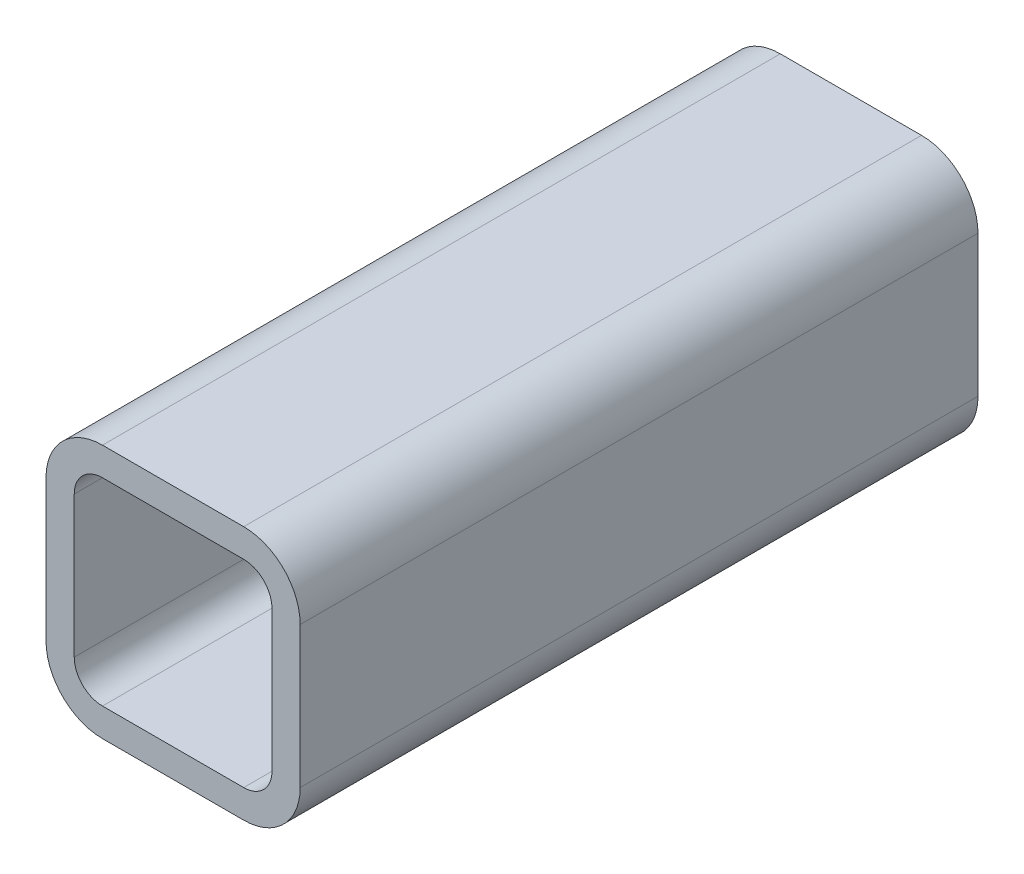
ISO-10303-21;
HEADER;
FILE_DESCRIPTION(('STEP AP214'),'2;1');
FILE_NAME('part.step','',(''),(''),'','','');
FILE_SCHEMA(('AUTOMOTIVE_DESIGN { 1 0 10303 214 1 1 1 1 }'));
ENDSEC;
DATA;
#1=APPLICATION_CONTEXT('core data for automotive mechanical design processes');
#2=APPLICATION_PROTOCOL_DEFINITION('international standard','automotive_design',2000,#1);
#3=PRODUCT_CONTEXT('',#1,'mechanical');
#4=PRODUCT('Part','Part','',(#3));
#5=PRODUCT_RELATED_PRODUCT_CATEGORY('part','',(#4));
#6=PRODUCT_DEFINITION_FORMATION('','',#4);
#7=PRODUCT_DEFINITION_CONTEXT('part definition',#1,'design');
#8=PRODUCT_DEFINITION('design','',#6,#7);
#9=PRODUCT_DEFINITION_SHAPE('','',#8);
#10=(LENGTH_UNIT() NAMED_UNIT(*) SI_UNIT(.MILLI.,.METRE.));
#11=(NAMED_UNIT(*) PLANE_ANGLE_UNIT() SI_UNIT($,.RADIAN.));
#12=(NAMED_UNIT(*) SI_UNIT($,.STERADIAN.) SOLID_ANGLE_UNIT());
#13=UNCERTAINTY_MEASURE_WITH_UNIT(LENGTH_MEASURE(1.E-05),#10,'distance_accuracy_value','');
#14=(GEOMETRIC_REPRESENTATION_CONTEXT(3) GLOBAL_UNCERTAINTY_ASSIGNED_CONTEXT((#13)) GLOBAL_UNIT_ASSIGNED_CONTEXT((#10,
#11,#12)) REPRESENTATION_CONTEXT('',''));
#15=CARTESIAN_POINT('',(0.,0.,0.));
#16=DIRECTION('',(0.,0.,1.));
#17=DIRECTION('',(1.,0.,0.));
#18=AXIS2_PLACEMENT_3D('',#15,#16,#17);
#19=CARTESIAN_POINT('',(26.6682087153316,89.6786017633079,304.8));
#20=DIRECTION('',(0.,0.,1.));
#21=DIRECTION('',(1.,0.,0.));
#22=AXIS2_PLACEMENT_3D('',#19,#20,#21);
#23=PLANE('',#22);
#24=CARTESIAN_POINT('',(26.6682087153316,89.6786017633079,304.8));
#25=DIRECTION('',(0.,0.,1.));
#26=DIRECTION('',(1.,0.,0.));
#27=AXIS2_PLACEMENT_3D('',#24,#25,#26);
#28=CIRCLE('',#27,25.4);
#29=CARTESIAN_POINT('',(26.6682087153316,115.078601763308,304.8));
#30=VERTEX_POINT('',#29);
#31=CARTESIAN_POINT('',(1.26820871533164,89.6786017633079,304.8));
#32=VERTEX_POINT('',#31);
#33=EDGE_CURVE('E211',#30,#32,#28,.T.);
#34=ORIENTED_EDGE('',*,*,#33,.T.);
#35=DIRECTION('',(0.,-1.,0.));
#36=VECTOR('',#35,1.);
#37=CARTESIAN_POINT('',(1.26820871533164,26.1786017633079,304.8));
#38=LINE('',#37,#36);
#39=CARTESIAN_POINT('',(1.26820871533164,26.1786017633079,304.8));
#40=VERTEX_POINT('',#39);
#41=EDGE_CURVE('E214',#32,#40,#38,.T.);
#42=ORIENTED_EDGE('',*,*,#41,.T.);
#43=CARTESIAN_POINT('',(26.6682087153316,26.1786017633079,304.8));
#44=DIRECTION('',(0.,0.,1.));
#45=DIRECTION('',(1.,0.,0.));
#46=AXIS2_PLACEMENT_3D('',#43,#44,#45);
#47=CIRCLE('',#46,25.4);
#48=CARTESIAN_POINT('',(26.6682087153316,0.77860176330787,304.8));
#49=VERTEX_POINT('',#48);
#50=EDGE_CURVE('E217',#40,#49,#47,.T.);
#51=ORIENTED_EDGE('',*,*,#50,.T.);
#52=DIRECTION('',(1.,0.,0.));
#53=VECTOR('',#52,1.);
#54=CARTESIAN_POINT('',(90.1682087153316,0.77860176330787,304.8));
#55=LINE('',#54,#53);
#56=CARTESIAN_POINT('',(90.1682087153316,0.778601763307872,304.8));
#57=VERTEX_POINT('',#56);
#58=EDGE_CURVE('E219',#49,#57,#55,.T.);
#59=ORIENTED_EDGE('',*,*,#58,.T.);
#60=CARTESIAN_POINT('',(90.1682087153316,26.1786017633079,304.8));
#61=DIRECTION('',(0.,0.,1.));
#62=DIRECTION('',(1.,0.,0.));
#63=AXIS2_PLACEMENT_3D('',#60,#61,#62);
#64=CIRCLE('',#63,25.4);
#65=CARTESIAN_POINT('',(115.568208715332,26.1786017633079,304.8));
#66=VERTEX_POINT('',#65);
#67=EDGE_CURVE('E221',#57,#66,#64,.T.);
#68=ORIENTED_EDGE('',*,*,#67,.T.);
#69=DIRECTION('',(0.,1.,0.));
#70=VECTOR('',#69,1.);
#71=CARTESIAN_POINT('',(115.568208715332,89.6786017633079,304.8));
#72=LINE('',#71,#70);
#73=CARTESIAN_POINT('',(115.568208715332,89.6786017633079,304.8));
#74=VERTEX_POINT('',#73);
#75=EDGE_CURVE('E223',#66,#74,#72,.T.);
#76=ORIENTED_EDGE('',*,*,#75,.T.);
#77=CARTESIAN_POINT('',(90.1682087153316,89.6786017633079,304.8));
#78=DIRECTION('',(0.,0.,1.));
#79=DIRECTION('',(1.,0.,0.));
#80=AXIS2_PLACEMENT_3D('',#77,#78,#79);
#81=CIRCLE('',#80,25.4);
#82=CARTESIAN_POINT('',(90.1682087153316,115.078601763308,304.8));
#83=VERTEX_POINT('',#82);
#84=EDGE_CURVE('E225',#74,#83,#81,.T.);
#85=ORIENTED_EDGE('',*,*,#84,.T.);
#86=DIRECTION('',(-1.,0.,0.));
#87=VECTOR('',#86,1.);
#88=CARTESIAN_POINT('',(26.6682087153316,115.078601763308,304.8));
#89=LINE('',#88,#87);
#90=EDGE_CURVE('E227',#83,#30,#89,.T.);
#91=ORIENTED_EDGE('',*,*,#90,.T.);
#92=EDGE_LOOP('',(#34,#42,#51,#59,#68,#76,#85,#91));
#93=FACE_BOUND('',#92,.T.);
#94=DIRECTION('',(0.,-1.,0.));
#95=VECTOR('',#94,1.);
#96=CARTESIAN_POINT('',(13.9682087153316,26.1786017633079,304.8));
#97=LINE('',#96,#95);
#98=CARTESIAN_POINT('',(13.9682087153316,89.6786017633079,304.8));
#99=VERTEX_POINT('',#98);
#100=CARTESIAN_POINT('',(13.9682087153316,26.1786017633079,304.8));
#101=VERTEX_POINT('',#100);
#102=EDGE_CURVE('E154',#99,#101,#97,.T.);
#103=ORIENTED_EDGE('',*,*,#102,.F.);
#104=CARTESIAN_POINT('',(26.6682087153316,89.6786017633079,304.8));
#105=DIRECTION('',(0.,0.,1.));
#106=DIRECTION('',(1.,0.,0.));
#107=AXIS2_PLACEMENT_3D('',#104,#105,#106);
#108=CIRCLE('',#107,12.7);
#109=CARTESIAN_POINT('',(26.6682087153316,102.378601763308,304.8));
#110=VERTEX_POINT('',#109);
#111=EDGE_CURVE('E146',#110,#99,#108,.T.);
#112=ORIENTED_EDGE('',*,*,#111,.F.);
#113=DIRECTION('',(-1.,0.,0.));
#114=VECTOR('',#113,1.);
#115=CARTESIAN_POINT('',(26.6682087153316,102.378601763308,304.8));
#116=LINE('',#115,#114);
#117=CARTESIAN_POINT('',(90.1682087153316,102.378601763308,304.8));
#118=VERTEX_POINT('',#117);
#119=EDGE_CURVE('E179',#118,#110,#116,.T.);
#120=ORIENTED_EDGE('',*,*,#119,.F.);
#121=CARTESIAN_POINT('',(90.1682087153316,89.6786017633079,304.8));
#122=DIRECTION('',(0.,0.,1.));
#123=DIRECTION('',(1.,0.,0.));
#124=AXIS2_PLACEMENT_3D('',#121,#122,#123);
#125=CIRCLE('',#124,12.7);
#126=CARTESIAN_POINT('',(102.868208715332,89.6786017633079,304.8));
#127=VERTEX_POINT('',#126);
#128=EDGE_CURVE('E177',#127,#118,#125,.T.);
#129=ORIENTED_EDGE('',*,*,#128,.F.);
#130=DIRECTION('',(0.,1.,0.));
#131=VECTOR('',#130,1.);
#132=CARTESIAN_POINT('',(102.868208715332,89.6786017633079,304.8));
#133=LINE('',#132,#131);
#134=CARTESIAN_POINT('',(102.868208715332,26.1786017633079,304.8));
#135=VERTEX_POINT('',#134);
#136=EDGE_CURVE('E175',#135,#127,#133,.T.);
#137=ORIENTED_EDGE('',*,*,#136,.F.);
#138=CARTESIAN_POINT('',(90.1682087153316,26.1786017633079,304.8));
#139=DIRECTION('',(0.,0.,1.));
#140=DIRECTION('',(1.,0.,0.));
#141=AXIS2_PLACEMENT_3D('',#138,#139,#140);
#142=CIRCLE('',#141,12.7);
#143=CARTESIAN_POINT('',(90.1682087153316,13.4786017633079,304.8));
#144=VERTEX_POINT('',#143);
#145=EDGE_CURVE('E173',#144,#135,#142,.T.);
#146=ORIENTED_EDGE('',*,*,#145,.F.);
#147=DIRECTION('',(1.,0.,0.));
#148=VECTOR('',#147,1.);
#149=CARTESIAN_POINT('',(90.1682087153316,13.4786017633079,304.8));
#150=LINE('',#149,#148);
#151=CARTESIAN_POINT('',(26.6682087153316,13.4786017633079,304.8));
#152=VERTEX_POINT('',#151);
#153=EDGE_CURVE('E169',#152,#144,#150,.T.);
#154=ORIENTED_EDGE('',*,*,#153,.F.);
#155=CARTESIAN_POINT('',(26.6682087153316,26.1786017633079,304.8));
#156=DIRECTION('',(0.,0.,1.));
#157=DIRECTION('',(1.,0.,0.));
#158=AXIS2_PLACEMENT_3D('',#155,#156,#157);
#159=CIRCLE('',#158,12.7);
#160=EDGE_CURVE('E167',#101,#152,#159,.T.);
#161=ORIENTED_EDGE('',*,*,#160,.F.);
#162=EDGE_LOOP('',(#103,#112,#120,#129,#137,#146,#154,#161));
#163=FACE_BOUND('',#162,.T.);
#164=ADVANCED_FACE('F33',(#93,#163),#23,.T.);
#165=CARTESIAN_POINT('',(26.6682087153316,89.6786017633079,0.));
#166=DIRECTION('',(0.,0.,1.));
#167=DIRECTION('',(1.,0.,0.));
#168=AXIS2_PLACEMENT_3D('',#165,#166,#167);
#169=PLANE('',#168);
#170=CARTESIAN_POINT('',(26.6682087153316,89.6786017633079,0.));
#171=DIRECTION('',(0.,0.,1.));
#172=DIRECTION('',(1.,0.,0.));
#173=AXIS2_PLACEMENT_3D('',#170,#171,#172);
#174=CIRCLE('',#173,25.4);
#175=CARTESIAN_POINT('',(26.6682087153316,115.078601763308,0.));
#176=VERTEX_POINT('',#175);
#177=CARTESIAN_POINT('',(1.26820871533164,89.6786017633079,0.));
#178=VERTEX_POINT('',#177);
#179=EDGE_CURVE('E162',#176,#178,#174,.T.);
#180=ORIENTED_EDGE('',*,*,#179,.F.);
#181=DIRECTION('',(-1.,0.,0.));
#182=VECTOR('',#181,1.);
#183=CARTESIAN_POINT('',(26.6682087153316,115.078601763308,0.));
#184=LINE('',#183,#182);
#185=CARTESIAN_POINT('',(90.1682087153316,115.078601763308,0.));
#186=VERTEX_POINT('',#185);
#187=EDGE_CURVE('E215',#186,#176,#184,.T.);
#188=ORIENTED_EDGE('',*,*,#187,.F.);
#189=CARTESIAN_POINT('',(90.1682087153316,89.6786017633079,0.));
#190=DIRECTION('',(0.,0.,1.));
#191=DIRECTION('',(1.,0.,0.));
#192=AXIS2_PLACEMENT_3D('',#189,#190,#191);
#193=CIRCLE('',#192,25.4);
#194=CARTESIAN_POINT('',(115.568208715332,89.6786017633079,0.));
#195=VERTEX_POINT('',#194);
#196=EDGE_CURVE('E242',#195,#186,#193,.T.);
#197=ORIENTED_EDGE('',*,*,#196,.F.);
#198=DIRECTION('',(0.,1.,0.));
#199=VECTOR('',#198,1.);
#200=CARTESIAN_POINT('',(115.568208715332,89.6786017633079,0.));
#201=LINE('',#200,#199);
#202=CARTESIAN_POINT('',(115.568208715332,26.1786017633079,0.));
#203=VERTEX_POINT('',#202);
#204=EDGE_CURVE('E240',#203,#195,#201,.T.);
#205=ORIENTED_EDGE('',*,*,#204,.F.);
#206=CARTESIAN_POINT('',(90.1682087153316,26.1786017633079,0.));
#207=DIRECTION('',(0.,0.,1.));
#208=DIRECTION('',(1.,0.,0.));
#209=AXIS2_PLACEMENT_3D('',#206,#207,#208);
#210=CIRCLE('',#209,25.4);
#211=CARTESIAN_POINT('',(90.1682087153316,0.778601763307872,0.));
#212=VERTEX_POINT('',#211);
#213=EDGE_CURVE('E238',#212,#203,#210,.T.);
#214=ORIENTED_EDGE('',*,*,#213,.F.);
#215=DIRECTION('',(1.,0.,0.));
#216=VECTOR('',#215,1.);
#217=CARTESIAN_POINT('',(90.1682087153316,0.77860176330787,0.));
#218=LINE('',#217,#216);
#219=CARTESIAN_POINT('',(26.6682087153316,0.77860176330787,0.));
#220=VERTEX_POINT('',#219);
#221=EDGE_CURVE('E236',#220,#212,#218,.T.);
#222=ORIENTED_EDGE('',*,*,#221,.F.);
#223=CARTESIAN_POINT('',(26.6682087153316,26.1786017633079,0.));
#224=DIRECTION('',(0.,0.,1.));
#225=DIRECTION('',(1.,0.,0.));
#226=AXIS2_PLACEMENT_3D('',#223,#224,#225);
#227=CIRCLE('',#226,25.4);
#228=CARTESIAN_POINT('',(1.26820871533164,26.1786017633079,0.));
#229=VERTEX_POINT('',#228);
#230=EDGE_CURVE('E234',#229,#220,#227,.T.);
#231=ORIENTED_EDGE('',*,*,#230,.F.);
#232=DIRECTION('',(0.,-1.,0.));
#233=VECTOR('',#232,1.);
#234=CARTESIAN_POINT('',(1.26820871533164,26.1786017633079,0.));
#235=LINE('',#234,#233);
#236=EDGE_CURVE('E232',#178,#229,#235,.T.);
#237=ORIENTED_EDGE('',*,*,#236,.F.);
#238=EDGE_LOOP('',(#180,#188,#197,#205,#214,#222,#231,#237));
#239=FACE_BOUND('',#238,.T.);
#240=CARTESIAN_POINT('',(26.6682087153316,89.6786017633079,0.));
#241=DIRECTION('',(0.,0.,1.));
#242=DIRECTION('',(1.,0.,0.));
#243=AXIS2_PLACEMENT_3D('',#240,#241,#242);
#244=CIRCLE('',#243,12.7);
#245=CARTESIAN_POINT('',(26.6682087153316,102.378601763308,0.));
#246=VERTEX_POINT('',#245);
#247=CARTESIAN_POINT('',(13.9682087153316,89.6786017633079,0.));
#248=VERTEX_POINT('',#247);
#249=EDGE_CURVE('E56',#246,#248,#244,.T.);
#250=ORIENTED_EDGE('',*,*,#249,.T.);
#251=DIRECTION('',(0.,-1.,0.));
#252=VECTOR('',#251,1.);
#253=CARTESIAN_POINT('',(13.9682087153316,26.1786017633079,0.));
#254=LINE('',#253,#252);
#255=CARTESIAN_POINT('',(13.9682087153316,26.1786017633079,0.));
#256=VERTEX_POINT('',#255);
#257=EDGE_CURVE('E161',#248,#256,#254,.T.);
#258=ORIENTED_EDGE('',*,*,#257,.T.);
#259=CARTESIAN_POINT('',(26.6682087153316,26.1786017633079,0.));
#260=DIRECTION('',(0.,0.,1.));
#261=DIRECTION('',(1.,0.,0.));
#262=AXIS2_PLACEMENT_3D('',#259,#260,#261);
#263=CIRCLE('',#262,12.7);
#264=CARTESIAN_POINT('',(26.6682087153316,13.4786017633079,0.));
#265=VERTEX_POINT('',#264);
#266=EDGE_CURVE('E183',#256,#265,#263,.T.);
#267=ORIENTED_EDGE('',*,*,#266,.T.);
#268=DIRECTION('',(1.,0.,0.));
#269=VECTOR('',#268,1.);
#270=CARTESIAN_POINT('',(90.1682087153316,13.4786017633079,0.));
#271=LINE('',#270,#269);
#272=CARTESIAN_POINT('',(90.1682087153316,13.4786017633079,0.));
#273=VERTEX_POINT('',#272);
#274=EDGE_CURVE('E186',#265,#273,#271,.T.);
#275=ORIENTED_EDGE('',*,*,#274,.T.);
#276=CARTESIAN_POINT('',(90.1682087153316,26.1786017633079,0.));
#277=DIRECTION('',(0.,0.,1.));
#278=DIRECTION('',(1.,0.,0.));
#279=AXIS2_PLACEMENT_3D('',#276,#277,#278);
#280=CIRCLE('',#279,12.7);
#281=CARTESIAN_POINT('',(102.868208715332,26.1786017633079,0.));
#282=VERTEX_POINT('',#281);
#283=EDGE_CURVE('E189',#273,#282,#280,.T.);
#284=ORIENTED_EDGE('',*,*,#283,.T.);
#285=DIRECTION('',(0.,1.,0.));
#286=VECTOR('',#285,1.);
#287=CARTESIAN_POINT('',(102.868208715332,89.6786017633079,0.));
#288=LINE('',#287,#286);
#289=CARTESIAN_POINT('',(102.868208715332,89.6786017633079,0.));
#290=VERTEX_POINT('',#289);
#291=EDGE_CURVE('E192',#282,#290,#288,.T.);
#292=ORIENTED_EDGE('',*,*,#291,.T.);
#293=CARTESIAN_POINT('',(90.1682087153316,89.6786017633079,0.));
#294=DIRECTION('',(0.,0.,1.));
#295=DIRECTION('',(1.,0.,0.));
#296=AXIS2_PLACEMENT_3D('',#293,#294,#295);
#297=CIRCLE('',#296,12.7);
#298=CARTESIAN_POINT('',(90.1682087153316,102.378601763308,0.));
#299=VERTEX_POINT('',#298);
#300=EDGE_CURVE('E195',#290,#299,#297,.T.);
#301=ORIENTED_EDGE('',*,*,#300,.T.);
#302=DIRECTION('',(-1.,0.,0.));
#303=VECTOR('',#302,1.);
#304=CARTESIAN_POINT('',(26.6682087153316,102.378601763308,0.));
#305=LINE('',#304,#303);
#306=EDGE_CURVE('E155',#299,#246,#305,.T.);
#307=ORIENTED_EDGE('',*,*,#306,.T.);
#308=EDGE_LOOP('',(#250,#258,#267,#275,#284,#292,#301,#307));
#309=FACE_BOUND('',#308,.T.);
#310=ADVANCED_FACE('F272',(#239,#309),#169,.F.);
#311=CARTESIAN_POINT('',(26.6682087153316,89.6786017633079,304.8));
#312=DIRECTION('',(0.,0.,-1.));
#313=DIRECTION('',(-1.,0.,0.));
#314=AXIS2_PLACEMENT_3D('',#311,#312,#313);
#315=CYLINDRICAL_SURFACE('',#314,25.4);
#316=ORIENTED_EDGE('',*,*,#179,.T.);
#317=DIRECTION('',(0.,0.,-1.));
#318=VECTOR('',#317,1.);
#319=CARTESIAN_POINT('',(1.26820871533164,89.6786017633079,304.8));
#320=LINE('',#319,#318);
#321=EDGE_CURVE('E11',#32,#178,#320,.T.);
#322=ORIENTED_EDGE('',*,*,#321,.F.);
#323=ORIENTED_EDGE('',*,*,#33,.F.);
#324=DIRECTION('',(0.,0.,-1.));
#325=VECTOR('',#324,1.);
#326=CARTESIAN_POINT('',(26.6682087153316,115.078601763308,304.8));
#327=LINE('',#326,#325);
#328=EDGE_CURVE('E229',#30,#176,#327,.T.);
#329=ORIENTED_EDGE('',*,*,#328,.T.);
#330=EDGE_LOOP('',(#316,#322,#323,#329));
#331=FACE_BOUND('',#330,.T.);
#332=ADVANCED_FACE('F35',(#331),#315,.T.);
#333=CARTESIAN_POINT('',(1.26820871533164,26.1786017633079,304.8));
#334=DIRECTION('',(1.,0.,0.));
#335=DIRECTION('',(0.,0.,-1.));
#336=AXIS2_PLACEMENT_3D('',#333,#334,#335);
#337=PLANE('',#336);
#338=ORIENTED_EDGE('',*,*,#236,.T.);
#339=DIRECTION('',(0.,0.,-1.));
#340=VECTOR('',#339,1.);
#341=CARTESIAN_POINT('',(1.26820871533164,26.1786017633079,304.8));
#342=LINE('',#341,#340);
#343=EDGE_CURVE('E41',#40,#229,#342,.T.);
#344=ORIENTED_EDGE('',*,*,#343,.F.);
#345=ORIENTED_EDGE('',*,*,#41,.F.);
#346=ORIENTED_EDGE('',*,*,#321,.T.);
#347=EDGE_LOOP('',(#338,#344,#345,#346));
#348=FACE_BOUND('',#347,.T.);
#349=ADVANCED_FACE('F289',(#348),#337,.F.);
#350=CARTESIAN_POINT('',(26.6682087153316,26.1786017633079,304.8));
#351=DIRECTION('',(0.,0.,-1.));
#352=DIRECTION('',(-1.,0.,0.));
#353=AXIS2_PLACEMENT_3D('',#350,#351,#352);
#354=CYLINDRICAL_SURFACE('',#353,25.4);
#355=ORIENTED_EDGE('',*,*,#230,.T.);
#356=DIRECTION('',(0.,0.,-1.));
#357=VECTOR('',#356,1.);
#358=CARTESIAN_POINT('',(26.6682087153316,0.77860176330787,304.8));
#359=LINE('',#358,#357);
#360=EDGE_CURVE('E259',#49,#220,#359,.T.);
#361=ORIENTED_EDGE('',*,*,#360,.F.);
#362=ORIENTED_EDGE('',*,*,#50,.F.);
#363=ORIENTED_EDGE('',*,*,#343,.T.);
#364=EDGE_LOOP('',(#355,#361,#362,#363));
#365=FACE_BOUND('',#364,.T.);
#366=ADVANCED_FACE('F266',(#365),#354,.T.);
#367=CARTESIAN_POINT('',(90.1682087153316,0.77860176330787,304.8));
#368=DIRECTION('',(0.,1.,0.));
#369=DIRECTION('',(0.,0.,1.));
#370=AXIS2_PLACEMENT_3D('',#367,#368,#369);
#371=PLANE('',#370);
#372=ORIENTED_EDGE('',*,*,#221,.T.);
#373=DIRECTION('',(0.,0.,-1.));
#374=VECTOR('',#373,1.);
#375=CARTESIAN_POINT('',(90.1682087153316,0.778601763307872,304.8));
#376=LINE('',#375,#374);
#377=EDGE_CURVE('E256',#57,#212,#376,.T.);
#378=ORIENTED_EDGE('',*,*,#377,.F.);
#379=ORIENTED_EDGE('',*,*,#58,.F.);
#380=ORIENTED_EDGE('',*,*,#360,.T.);
#381=EDGE_LOOP('',(#372,#378,#379,#380));
#382=FACE_BOUND('',#381,.T.);
#383=ADVANCED_FACE('F278',(#382),#371,.F.);
#384=CARTESIAN_POINT('',(90.1682087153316,26.1786017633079,304.8));
#385=DIRECTION('',(0.,0.,-1.));
#386=DIRECTION('',(-1.,0.,0.));
#387=AXIS2_PLACEMENT_3D('',#384,#385,#386);
#388=CYLINDRICAL_SURFACE('',#387,25.4);
#389=ORIENTED_EDGE('',*,*,#213,.T.);
#390=DIRECTION('',(0.,0.,-1.));
#391=VECTOR('',#390,1.);
#392=CARTESIAN_POINT('',(115.568208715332,26.1786017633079,304.8));
#393=LINE('',#392,#391);
#394=EDGE_CURVE('E253',#66,#203,#393,.T.);
#395=ORIENTED_EDGE('',*,*,#394,.F.);
#396=ORIENTED_EDGE('',*,*,#67,.F.);
#397=ORIENTED_EDGE('',*,*,#377,.T.);
#398=EDGE_LOOP('',(#389,#395,#396,#397));
#399=FACE_BOUND('',#398,.T.);
#400=ADVANCED_FACE('F282',(#399),#388,.T.);
#401=CARTESIAN_POINT('',(115.568208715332,89.6786017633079,304.8));
#402=DIRECTION('',(-1.,0.,0.));
#403=DIRECTION('',(0.,0.,1.));
#404=AXIS2_PLACEMENT_3D('',#401,#402,#403);
#405=PLANE('',#404);
#406=ORIENTED_EDGE('',*,*,#204,.T.);
#407=DIRECTION('',(0.,0.,-1.));
#408=VECTOR('',#407,1.);
#409=CARTESIAN_POINT('',(115.568208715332,89.6786017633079,304.8));
#410=LINE('',#409,#408);
#411=EDGE_CURVE('E250',#74,#195,#410,.T.);
#412=ORIENTED_EDGE('',*,*,#411,.F.);
#413=ORIENTED_EDGE('',*,*,#75,.F.);
#414=ORIENTED_EDGE('',*,*,#394,.T.);
#415=EDGE_LOOP('',(#406,#412,#413,#414));
#416=FACE_BOUND('',#415,.T.);
#417=ADVANCED_FACE('F302',(#416),#405,.F.);
#418=CARTESIAN_POINT('',(90.1682087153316,89.6786017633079,304.8));
#419=DIRECTION('',(0.,0.,-1.));
#420=DIRECTION('',(-1.,0.,0.));
#421=AXIS2_PLACEMENT_3D('',#418,#419,#420);
#422=CYLINDRICAL_SURFACE('',#421,25.4);
#423=ORIENTED_EDGE('',*,*,#196,.T.);
#424=DIRECTION('',(0.,0.,-1.));
#425=VECTOR('',#424,1.);
#426=CARTESIAN_POINT('',(90.1682087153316,115.078601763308,304.8));
#427=LINE('',#426,#425);
#428=EDGE_CURVE('E247',#83,#186,#427,.T.);
#429=ORIENTED_EDGE('',*,*,#428,.F.);
#430=ORIENTED_EDGE('',*,*,#84,.F.);
#431=ORIENTED_EDGE('',*,*,#411,.T.);
#432=EDGE_LOOP('',(#423,#429,#430,#431));
#433=FACE_BOUND('',#432,.T.);
#434=ADVANCED_FACE('F300',(#433),#422,.T.);
#435=CARTESIAN_POINT('',(26.6682087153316,115.078601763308,304.8));
#436=DIRECTION('',(0.,-1.,0.));
#437=DIRECTION('',(0.,0.,-1.));
#438=AXIS2_PLACEMENT_3D('',#435,#436,#437);
#439=PLANE('',#438);
#440=ORIENTED_EDGE('',*,*,#187,.T.);
#441=ORIENTED_EDGE('',*,*,#328,.F.);
#442=ORIENTED_EDGE('',*,*,#90,.F.);
#443=ORIENTED_EDGE('',*,*,#428,.T.);
#444=EDGE_LOOP('',(#440,#441,#442,#443));
#445=FACE_BOUND('',#444,.T.);
#446=ADVANCED_FACE('F295',(#445),#439,.F.);
#447=CARTESIAN_POINT('',(26.6682087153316,89.6786017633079,304.8));
#448=DIRECTION('',(0.,0.,-1.));
#449=DIRECTION('',(-1.,0.,0.));
#450=AXIS2_PLACEMENT_3D('',#447,#448,#449);
#451=CYLINDRICAL_SURFACE('',#450,12.7);
#452=ORIENTED_EDGE('',*,*,#249,.F.);
#453=DIRECTION('',(0.,0.,-1.));
#454=VECTOR('',#453,1.);
#455=CARTESIAN_POINT('',(26.6682087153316,102.378601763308,304.8));
#456=LINE('',#455,#454);
#457=EDGE_CURVE('E150',#110,#246,#456,.T.);
#458=ORIENTED_EDGE('',*,*,#457,.F.);
#459=ORIENTED_EDGE('',*,*,#111,.T.);
#460=DIRECTION('',(0.,0.,-1.));
#461=VECTOR('',#460,1.);
#462=CARTESIAN_POINT('',(13.9682087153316,89.6786017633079,304.8));
#463=LINE('',#462,#461);
#464=EDGE_CURVE('E149',#99,#248,#463,.T.);
#465=ORIENTED_EDGE('',*,*,#464,.T.);
#466=EDGE_LOOP('',(#452,#458,#459,#465));
#467=FACE_BOUND('',#466,.T.);
#468=ADVANCED_FACE('F148',(#467),#451,.F.);
#469=CARTESIAN_POINT('',(13.9682087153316,26.1786017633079,304.8));
#470=DIRECTION('',(1.,0.,0.));
#471=DIRECTION('',(0.,0.,-1.));
#472=AXIS2_PLACEMENT_3D('',#469,#470,#471);
#473=PLANE('',#472);
#474=ORIENTED_EDGE('',*,*,#257,.F.);
#475=ORIENTED_EDGE('',*,*,#464,.F.);
#476=ORIENTED_EDGE('',*,*,#102,.T.);
#477=DIRECTION('',(0.,0.,-1.));
#478=VECTOR('',#477,1.);
#479=CARTESIAN_POINT('',(13.9682087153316,26.1786017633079,304.8));
#480=LINE('',#479,#478);
#481=EDGE_CURVE('E163',#101,#256,#480,.T.);
#482=ORIENTED_EDGE('',*,*,#481,.T.);
#483=EDGE_LOOP('',(#474,#475,#476,#482));
#484=FACE_BOUND('',#483,.T.);
#485=ADVANCED_FACE('F158',(#484),#473,.T.);
#486=CARTESIAN_POINT('',(26.6682087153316,26.1786017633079,304.8));
#487=DIRECTION('',(0.,0.,-1.));
#488=DIRECTION('',(-1.,0.,0.));
#489=AXIS2_PLACEMENT_3D('',#486,#487,#488);
#490=CYLINDRICAL_SURFACE('',#489,12.7);
#491=ORIENTED_EDGE('',*,*,#266,.F.);
#492=ORIENTED_EDGE('',*,*,#481,.F.);
#493=ORIENTED_EDGE('',*,*,#160,.T.);
#494=DIRECTION('',(0.,0.,-1.));
#495=VECTOR('',#494,1.);
#496=CARTESIAN_POINT('',(26.6682087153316,13.4786017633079,304.8));
#497=LINE('',#496,#495);
#498=EDGE_CURVE('E208',#152,#265,#497,.T.);
#499=ORIENTED_EDGE('',*,*,#498,.T.);
#500=EDGE_LOOP('',(#491,#492,#493,#499));
#501=FACE_BOUND('',#500,.T.);
#502=ADVANCED_FACE('F327',(#501),#490,.F.);
#503=CARTESIAN_POINT('',(90.1682087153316,13.4786017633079,304.8));
#504=DIRECTION('',(0.,1.,0.));
#505=DIRECTION('',(0.,0.,1.));
#506=AXIS2_PLACEMENT_3D('',#503,#504,#505);
#507=PLANE('',#506);
#508=ORIENTED_EDGE('',*,*,#274,.F.);
#509=ORIENTED_EDGE('',*,*,#498,.F.);
#510=ORIENTED_EDGE('',*,*,#153,.T.);
#511=DIRECTION('',(0.,0.,-1.));
#512=VECTOR('',#511,1.);
#513=CARTESIAN_POINT('',(90.1682087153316,13.4786017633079,304.8));
#514=LINE('',#513,#512);
#515=EDGE_CURVE('E206',#144,#273,#514,.T.);
#516=ORIENTED_EDGE('',*,*,#515,.T.);
#517=EDGE_LOOP('',(#508,#509,#510,#516));
#518=FACE_BOUND('',#517,.T.);
#519=ADVANCED_FACE('F331',(#518),#507,.T.);
#520=CARTESIAN_POINT('',(90.1682087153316,26.1786017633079,304.8));
#521=DIRECTION('',(0.,0.,-1.));
#522=DIRECTION('',(-1.,0.,0.));
#523=AXIS2_PLACEMENT_3D('',#520,#521,#522);
#524=CYLINDRICAL_SURFACE('',#523,12.7);
#525=ORIENTED_EDGE('',*,*,#283,.F.);
#526=ORIENTED_EDGE('',*,*,#515,.F.);
#527=ORIENTED_EDGE('',*,*,#145,.T.);
#528=DIRECTION('',(0.,0.,-1.));
#529=VECTOR('',#528,1.);
#530=CARTESIAN_POINT('',(102.868208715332,26.1786017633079,304.8));
#531=LINE('',#530,#529);
#532=EDGE_CURVE('E204',#135,#282,#531,.T.);
#533=ORIENTED_EDGE('',*,*,#532,.T.);
#534=EDGE_LOOP('',(#525,#526,#527,#533));
#535=FACE_BOUND('',#534,.T.);
#536=ADVANCED_FACE('F337',(#535),#524,.F.);
#537=CARTESIAN_POINT('',(102.868208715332,89.6786017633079,304.8));
#538=DIRECTION('',(-1.,0.,0.));
#539=DIRECTION('',(0.,0.,1.));
#540=AXIS2_PLACEMENT_3D('',#537,#538,#539);
#541=PLANE('',#540);
#542=ORIENTED_EDGE('',*,*,#291,.F.);
#543=ORIENTED_EDGE('',*,*,#532,.F.);
#544=ORIENTED_EDGE('',*,*,#136,.T.);
#545=DIRECTION('',(0.,0.,-1.));
#546=VECTOR('',#545,1.);
#547=CARTESIAN_POINT('',(102.868208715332,89.6786017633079,304.8));
#548=LINE('',#547,#546);
#549=EDGE_CURVE('E202',#127,#290,#548,.T.);
#550=ORIENTED_EDGE('',*,*,#549,.T.);
#551=EDGE_LOOP('',(#542,#543,#544,#550));
#552=FACE_BOUND('',#551,.T.);
#553=ADVANCED_FACE('F341',(#552),#541,.T.);
#554=CARTESIAN_POINT('',(90.1682087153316,89.6786017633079,304.8));
#555=DIRECTION('',(0.,0.,-1.));
#556=DIRECTION('',(-1.,0.,0.));
#557=AXIS2_PLACEMENT_3D('',#554,#555,#556);
#558=CYLINDRICAL_SURFACE('',#557,12.7);
#559=ORIENTED_EDGE('',*,*,#300,.F.);
#560=ORIENTED_EDGE('',*,*,#549,.F.);
#561=ORIENTED_EDGE('',*,*,#128,.T.);
#562=DIRECTION('',(0.,0.,-1.));
#563=VECTOR('',#562,1.);
#564=CARTESIAN_POINT('',(90.1682087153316,102.378601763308,304.8));
#565=LINE('',#564,#563);
#566=EDGE_CURVE('E48',#118,#299,#565,.T.);
#567=ORIENTED_EDGE('',*,*,#566,.T.);
#568=EDGE_LOOP('',(#559,#560,#561,#567));
#569=FACE_BOUND('',#568,.T.);
#570=ADVANCED_FACE('F345',(#569),#558,.F.);
#571=CARTESIAN_POINT('',(26.6682087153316,102.378601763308,304.8));
#572=DIRECTION('',(0.,-1.,0.));
#573=DIRECTION('',(0.,0.,-1.));
#574=AXIS2_PLACEMENT_3D('',#571,#572,#573);
#575=PLANE('',#574);
#576=ORIENTED_EDGE('',*,*,#306,.F.);
#577=ORIENTED_EDGE('',*,*,#566,.F.);
#578=ORIENTED_EDGE('',*,*,#119,.T.);
#579=ORIENTED_EDGE('',*,*,#457,.T.);
#580=EDGE_LOOP('',(#576,#577,#578,#579));
#581=FACE_BOUND('',#580,.T.);
#582=ADVANCED_FACE('F349',(#581),#575,.T.);
#583=CLOSED_SHELL('',(#164,#310,#332,#349,#366,#383,#400,#417,#434,#446,#468,#485,#502,#519,
#536,#553,#570,#582));
#584=MANIFOLD_SOLID_BREP('B2',#583);
#585=ADVANCED_BREP_SHAPE_REPRESENTATION('',(#18,#584),#14);
#586=SHAPE_DEFINITION_REPRESENTATION(#9,#585);
ENDSEC;
END-ISO-10303-21;
